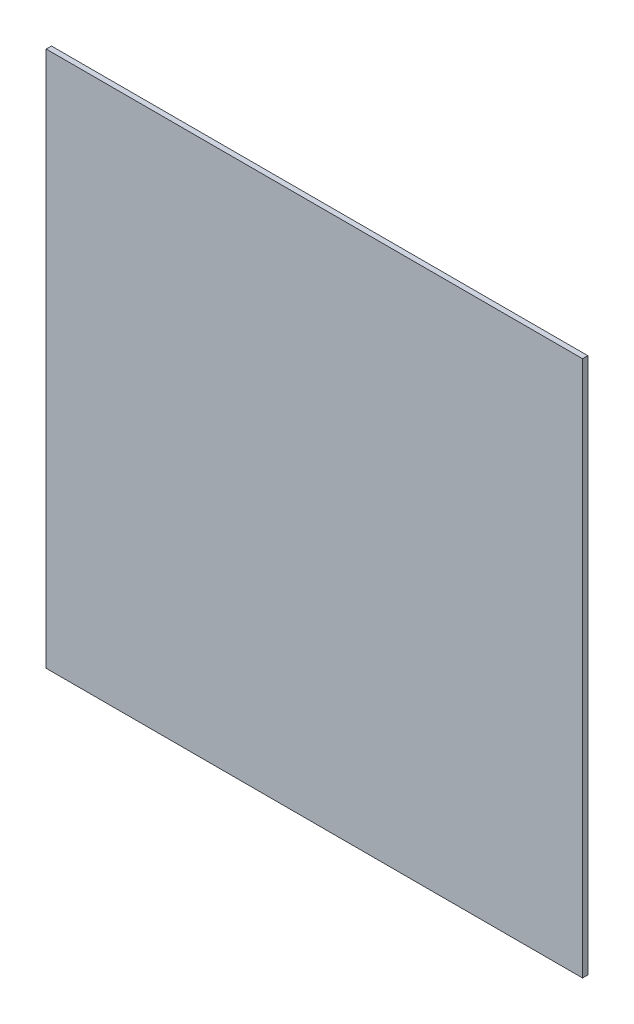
from build123d import *

# Parameters (mm, degrees)
SKETCH1_W           = 304.8
SKETCH1_H           = 304.8
BOSS_EXTRUDE1_DEPTH = 3


with BuildPart() as part:
    # Sketch1 → Boss-Extrude1 (new body)
    with BuildSketch(Plane(origin=(0, 0, 0), x_dir=(0, 1, 0), z_dir=(0, 0, 1))):
        Rectangle(SKETCH1_W, SKETCH1_H)
    extrude(amount=BOSS_EXTRUDE1_DEPTH)


solid = part.part
